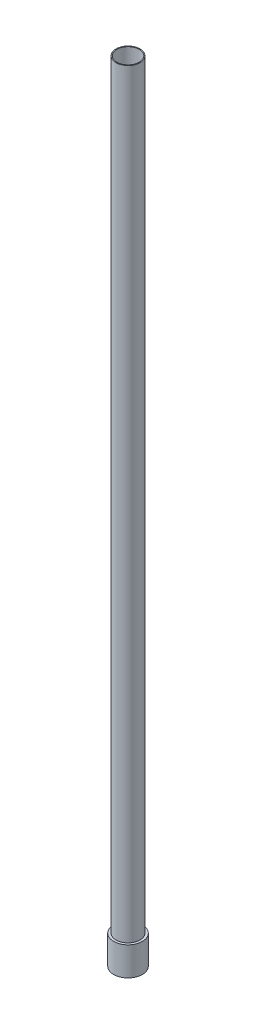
from build123d import *


with BuildPart() as part:
    # Sketch2 → Revolve1 (revolve)
    with BuildSketch(Plane.XY, mode=Mode.PRIVATE) as revolve1_sk:
        Polygon((-4.318, 0), (-5.5499, 0), (-5.5499, 11.0998), (-4.6355, 11.0998), (-4.6355, 304.8), (-4.318, 304.8), align=None)
    revolve(revolve1_sk.sketch.rotate(Axis((0, 0, 0), (0, 1, 0)), 270), axis=Axis((0, 0, 0), (0, 1, 0)))


solid = part.part
